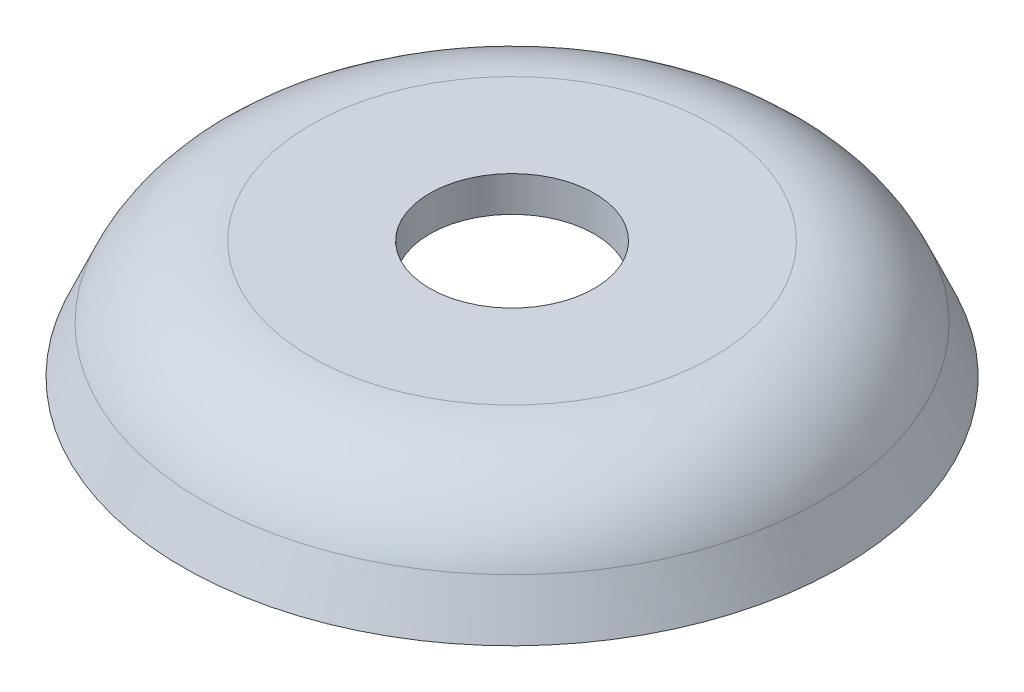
ISO-10303-21;
HEADER;
FILE_DESCRIPTION(('STEP AP214'),'2;1');
FILE_NAME('part.step','',(''),(''),'','','');
FILE_SCHEMA(('AUTOMOTIVE_DESIGN { 1 0 10303 214 1 1 1 1 }'));
ENDSEC;
DATA;
#1=APPLICATION_CONTEXT('core data for automotive mechanical design processes');
#2=APPLICATION_PROTOCOL_DEFINITION('international standard','automotive_design',2000,#1);
#3=PRODUCT_CONTEXT('',#1,'mechanical');
#4=PRODUCT('Part','Part','',(#3));
#5=PRODUCT_RELATED_PRODUCT_CATEGORY('part','',(#4));
#6=PRODUCT_DEFINITION_FORMATION('','',#4);
#7=PRODUCT_DEFINITION_CONTEXT('part definition',#1,'design');
#8=PRODUCT_DEFINITION('design','',#6,#7);
#9=PRODUCT_DEFINITION_SHAPE('','',#8);
#10=(LENGTH_UNIT() NAMED_UNIT(*) SI_UNIT(.MILLI.,.METRE.));
#11=(NAMED_UNIT(*) PLANE_ANGLE_UNIT() SI_UNIT($,.RADIAN.));
#12=(NAMED_UNIT(*) SI_UNIT($,.STERADIAN.) SOLID_ANGLE_UNIT());
#13=UNCERTAINTY_MEASURE_WITH_UNIT(LENGTH_MEASURE(1.E-05),#10,'distance_accuracy_value','');
#14=(GEOMETRIC_REPRESENTATION_CONTEXT(3) GLOBAL_UNCERTAINTY_ASSIGNED_CONTEXT((#13)) GLOBAL_UNIT_ASSIGNED_CONTEXT((#10,
#11,#12)) REPRESENTATION_CONTEXT('',''));
#15=CARTESIAN_POINT('',(0.,0.,0.));
#16=DIRECTION('',(0.,0.,1.));
#17=DIRECTION('',(1.,0.,0.));
#18=AXIS2_PLACEMENT_3D('',#15,#16,#17);
#19=CARTESIAN_POINT('',(0.,0.,0.));
#20=DIRECTION('',(0.,1.,0.));
#21=DIRECTION('',(0.,0.,1.));
#22=AXIS2_PLACEMENT_3D('',#19,#20,#21);
#23=PLANE('',#22);
#24=CARTESIAN_POINT('',(0.,0.,0.));
#25=DIRECTION('',(0.,1.,0.));
#26=DIRECTION('',(0.,0.,1.));
#27=AXIS2_PLACEMENT_3D('',#24,#25,#26);
#28=CIRCLE('',#27,3.5);
#29=CARTESIAN_POINT('',(0.,0.,3.5));
#30=VERTEX_POINT('',#29);
#31=EDGE_CURVE('E54',#30,#30,#28,.T.);
#32=ORIENTED_EDGE('',*,*,#31,.F.);
#33=EDGE_LOOP('',(#32));
#34=FACE_BOUND('',#33,.T.);
#35=CARTESIAN_POINT('',(0.,0.,0.));
#36=DIRECTION('',(0.,-1.,0.));
#37=DIRECTION('',(0.,0.,-1.));
#38=AXIS2_PLACEMENT_3D('',#35,#36,#37);
#39=CIRCLE('',#38,8.54459045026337);
#40=CARTESIAN_POINT('',(0.,0.,-8.54459045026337));
#41=VERTEX_POINT('',#40);
#42=EDGE_CURVE('E10',#41,#41,#39,.T.);
#43=ORIENTED_EDGE('',*,*,#42,.F.);
#44=EDGE_LOOP('',(#43));
#45=FACE_BOUND('',#44,.T.);
#46=ADVANCED_FACE('F29',(#34,#45),#23,.T.);
#47=CARTESIAN_POINT('',(0.,-5.,0.));
#48=DIRECTION('',(0.,-1.,0.));
#49=DIRECTION('',(0.,0.,-1.));
#50=AXIS2_PLACEMENT_3D('',#47,#48,#49);
#51=TOROIDAL_SURFACE('',#50,8.54459045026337,5.);
#52=ORIENTED_EDGE('',*,*,#42,.T.);
#53=EDGE_LOOP('',(#52));
#54=FACE_BOUND('',#53,.T.);
#55=CARTESIAN_POINT('',(0.,-3.00007257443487,0.));
#56=DIRECTION('',(0.,-1.,0.));
#57=DIRECTION('',(0.,0.,-1.));
#58=AXIS2_PLACEMENT_3D('',#55,#56,#57);
#59=CIRCLE('',#58,13.1271978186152);
#60=CARTESIAN_POINT('',(0.,-3.00007257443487,-13.1271978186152));
#61=VERTEX_POINT('',#60);
#62=EDGE_CURVE('E36',#61,#61,#59,.T.);
#63=ORIENTED_EDGE('',*,*,#62,.F.);
#64=EDGE_LOOP('',(#63));
#65=FACE_BOUND('',#64,.T.);
#66=ADVANCED_FACE('F81',(#54,#65),#51,.T.);
#67=CARTESIAN_POINT('',(0.,-5.,0.));
#68=DIRECTION('',(0.,-1.,0.));
#69=DIRECTION('',(0.,0.,-1.));
#70=AXIS2_PLACEMENT_3D('',#67,#68,#69);
#71=CONICAL_SURFACE('',#70,14.,0.411501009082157);
#72=ORIENTED_EDGE('',*,*,#62,.T.);
#73=EDGE_LOOP('',(#72));
#74=FACE_BOUND('',#73,.T.);
#75=CARTESIAN_POINT('',(0.,-5.,0.));
#76=DIRECTION('',(0.,-1.,0.));
#77=DIRECTION('',(0.,0.,-1.));
#78=AXIS2_PLACEMENT_3D('',#75,#76,#77);
#79=CIRCLE('',#78,14.);
#80=CARTESIAN_POINT('',(0.,-5.,-14.));
#81=VERTEX_POINT('',#80);
#82=EDGE_CURVE('E40',#81,#81,#79,.T.);
#83=ORIENTED_EDGE('',*,*,#82,.F.);
#84=EDGE_LOOP('',(#83));
#85=FACE_BOUND('',#84,.T.);
#86=ADVANCED_FACE('F86',(#74,#85),#71,.T.);
#87=CARTESIAN_POINT('',(0.,-5.59997822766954,0.));
#88=DIRECTION('',(0.,1.,0.));
#89=DIRECTION('',(0.,0.,1.));
#90=AXIS2_PLACEMENT_3D('',#87,#88,#89);
#91=CONICAL_SURFACE('',#90,12.6252177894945,1.15929531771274);
#92=ORIENTED_EDGE('',*,*,#82,.T.);
#93=EDGE_LOOP('',(#92));
#94=FACE_BOUND('',#93,.T.);
#95=CARTESIAN_POINT('',(0.,-5.59997822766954,0.));
#96=DIRECTION('',(0.,-1.,0.));
#97=DIRECTION('',(0.,0.,-1.));
#98=AXIS2_PLACEMENT_3D('',#95,#96,#97);
#99=CIRCLE('',#98,12.6252177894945);
#100=CARTESIAN_POINT('',(0.,-5.59997822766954,-12.6252177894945));
#101=VERTEX_POINT('',#100);
#102=EDGE_CURVE('E45',#101,#101,#99,.T.);
#103=ORIENTED_EDGE('',*,*,#102,.F.);
#104=EDGE_LOOP('',(#103));
#105=FACE_BOUND('',#104,.T.);
#106=ADVANCED_FACE('F77',(#94,#105),#91,.T.);
#107=CARTESIAN_POINT('',(0.,-3.60005080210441,0.));
#108=DIRECTION('',(0.,-1.,0.));
#109=DIRECTION('',(0.,0.,-1.));
#110=AXIS2_PLACEMENT_3D('',#107,#108,#109);
#111=CONICAL_SURFACE('',#110,11.7524156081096,0.411501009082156);
#112=ORIENTED_EDGE('',*,*,#102,.T.);
#113=EDGE_LOOP('',(#112));
#114=FACE_BOUND('',#113,.T.);
#115=CARTESIAN_POINT('',(0.,-3.60005080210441,0.));
#116=DIRECTION('',(0.,-1.,0.));
#117=DIRECTION('',(0.,0.,-1.));
#118=AXIS2_PLACEMENT_3D('',#115,#116,#117);
#119=CIRCLE('',#118,11.7524156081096);
#120=CARTESIAN_POINT('',(0.,-3.60005080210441,-11.7524156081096));
#121=VERTEX_POINT('',#120);
#122=EDGE_CURVE('E48',#121,#121,#119,.T.);
#123=ORIENTED_EDGE('',*,*,#122,.F.);
#124=EDGE_LOOP('',(#123));
#125=FACE_BOUND('',#124,.T.);
#126=ADVANCED_FACE('F71',(#114,#125),#111,.F.);
#127=CARTESIAN_POINT('',(0.,-5.,0.));
#128=DIRECTION('',(0.,-1.,0.));
#129=DIRECTION('',(0.,0.,-1.));
#130=AXIS2_PLACEMENT_3D('',#127,#128,#129);
#131=TOROIDAL_SURFACE('',#130,8.54459045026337,3.5);
#132=ORIENTED_EDGE('',*,*,#122,.T.);
#133=EDGE_LOOP('',(#132));
#134=FACE_BOUND('',#133,.T.);
#135=CARTESIAN_POINT('',(0.,-1.5,0.));
#136=DIRECTION('',(0.,-1.,0.));
#137=DIRECTION('',(0.,0.,-1.));
#138=AXIS2_PLACEMENT_3D('',#135,#136,#137);
#139=CIRCLE('',#138,8.54459045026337);
#140=CARTESIAN_POINT('',(0.,-1.5,-8.54459045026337));
#141=VERTEX_POINT('',#140);
#142=EDGE_CURVE('E51',#141,#141,#139,.T.);
#143=ORIENTED_EDGE('',*,*,#142,.F.);
#144=EDGE_LOOP('',(#143));
#145=FACE_BOUND('',#144,.T.);
#146=ADVANCED_FACE('F66',(#134,#145),#131,.F.);
#147=CARTESIAN_POINT('',(0.,-1.5,0.));
#148=DIRECTION('',(0.,-1.,0.));
#149=DIRECTION('',(0.,0.,-1.));
#150=AXIS2_PLACEMENT_3D('',#147,#148,#149);
#151=PLANE('',#150);
#152=CARTESIAN_POINT('',(0.,-1.5,0.));
#153=DIRECTION('',(0.,-1.,0.));
#154=DIRECTION('',(0.,0.,-1.));
#155=AXIS2_PLACEMENT_3D('',#152,#153,#154);
#156=CIRCLE('',#155,3.5);
#157=CARTESIAN_POINT('',(0.,-1.5,-3.5));
#158=VERTEX_POINT('',#157);
#159=EDGE_CURVE('E32',#158,#158,#156,.T.);
#160=ORIENTED_EDGE('',*,*,#159,.F.);
#161=EDGE_LOOP('',(#160));
#162=FACE_BOUND('',#161,.T.);
#163=ORIENTED_EDGE('',*,*,#142,.T.);
#164=EDGE_LOOP('',(#163));
#165=FACE_BOUND('',#164,.T.);
#166=ADVANCED_FACE('F63',(#162,#165),#151,.T.);
#167=CARTESIAN_POINT('',(0.,-5.59997822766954,0.));
#168=DIRECTION('',(0.,1.,0.));
#169=DIRECTION('',(0.,0.,1.));
#170=AXIS2_PLACEMENT_3D('',#167,#168,#169);
#171=CYLINDRICAL_SURFACE('',#170,3.5);
#172=ORIENTED_EDGE('',*,*,#159,.T.);
#173=EDGE_LOOP('',(#172));
#174=FACE_BOUND('',#173,.T.);
#175=ORIENTED_EDGE('',*,*,#31,.T.);
#176=EDGE_LOOP('',(#175));
#177=FACE_BOUND('',#176,.T.);
#178=ADVANCED_FACE('F61',(#174,#177),#171,.F.);
#179=CLOSED_SHELL('',(#46,#66,#86,#106,#126,#146,#166,#178));
#180=MANIFOLD_SOLID_BREP('B2',#179);
#181=ADVANCED_BREP_SHAPE_REPRESENTATION('',(#18,#180),#14);
#182=SHAPE_DEFINITION_REPRESENTATION(#9,#181);
ENDSEC;
END-ISO-10303-21;
